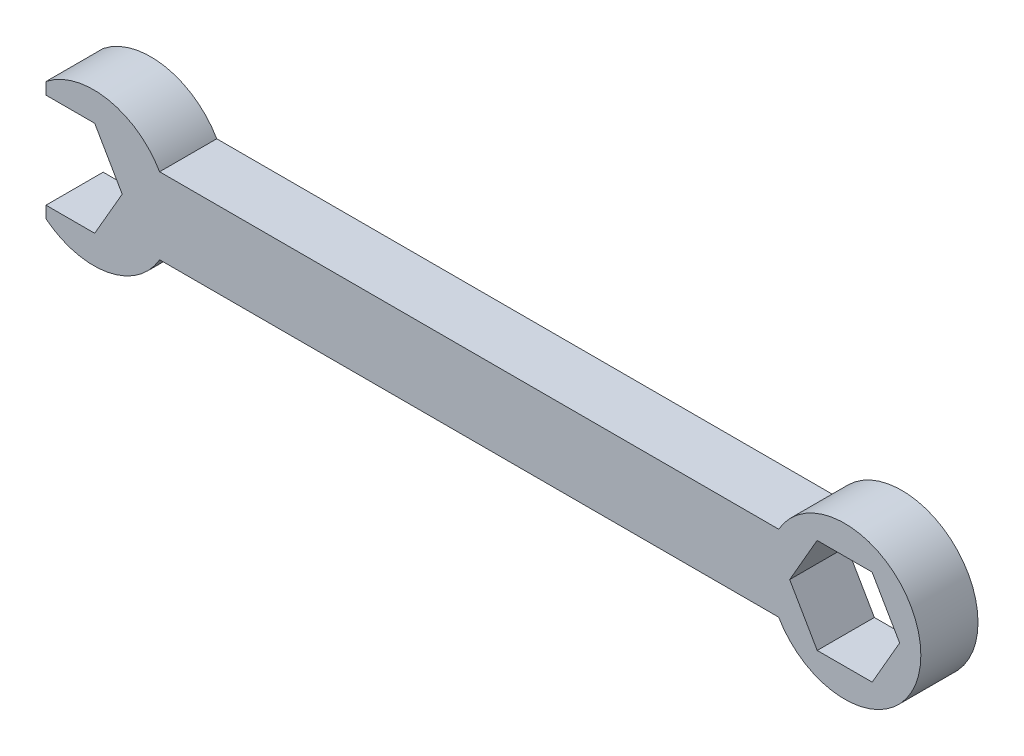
from build123d import *

# Parameters (mm, degrees)
BOSS_EXTRUDE2_DEPTH = 7.62


with BuildPart() as part:
    # Sketch1 → Boss-Extrude2 (new body)
    with BuildSketch(Plane.XY):
        with BuildLine():
            Line((-10.16, -6.35), (-3.666174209, -6.35))
            Line((-3.666174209, -6.35), (0, 0))
            Line((0, 0), (-3.666174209, 6.35))
            Line((-3.666174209, 6.35), (-10.16, 6.35))
            Line((-10.16, 6.35), (-10.16, 7.931147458))
            ThreePointArc((-10.16, 7.931147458), (-1.930787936, 9.984696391), (4.988818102, 5.08))
            Line((4.988818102, 5.08), (87.538818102, 5.08))
            ThreePointArc((87.538818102, 5.08), (106.497636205, 0), (87.538818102, -5.08))
            Line((87.538818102, -5.08), (4.988818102, -5.08))
            ThreePointArc((4.988818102, -5.08), (-1.930787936, -9.984696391), (-10.16, -7.931147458))
            Line((-10.16, -7.931147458), (-10.16, -6.35))
        make_face()
        Polygon((103.669981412, 0.00686265), (99.99786558, 6.353428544), (92.665520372, 6.346565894), (89.005290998, -0.00686265), (92.67740683, -6.353428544), (100.009752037, -6.346565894), align=None, mode=Mode.SUBTRACT)
    extrude(amount=-BOSS_EXTRUDE2_DEPTH)


solid = part.part
